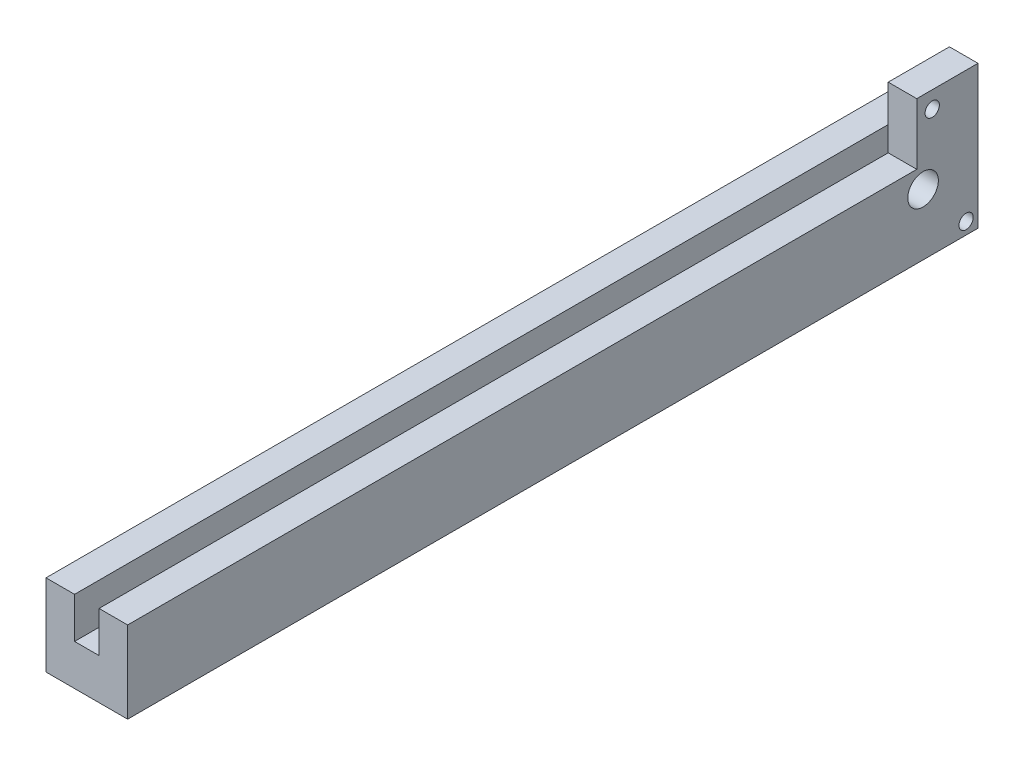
ISO-10303-21;
HEADER;
FILE_DESCRIPTION(('STEP AP214'),'2;1');
FILE_NAME('part.step','',(''),(''),'','','');
FILE_SCHEMA(('AUTOMOTIVE_DESIGN { 1 0 10303 214 1 1 1 1 }'));
ENDSEC;
DATA;
#1=APPLICATION_CONTEXT('core data for automotive mechanical design processes');
#2=APPLICATION_PROTOCOL_DEFINITION('international standard','automotive_design',2000,#1);
#3=PRODUCT_CONTEXT('',#1,'mechanical');
#4=PRODUCT('Part','Part','',(#3));
#5=PRODUCT_RELATED_PRODUCT_CATEGORY('part','',(#4));
#6=PRODUCT_DEFINITION_FORMATION('','',#4);
#7=PRODUCT_DEFINITION_CONTEXT('part definition',#1,'design');
#8=PRODUCT_DEFINITION('design','',#6,#7);
#9=PRODUCT_DEFINITION_SHAPE('','',#8);
#10=(LENGTH_UNIT() NAMED_UNIT(*) SI_UNIT(.MILLI.,.METRE.));
#11=(NAMED_UNIT(*) PLANE_ANGLE_UNIT() SI_UNIT($,.RADIAN.));
#12=(NAMED_UNIT(*) SI_UNIT($,.STERADIAN.) SOLID_ANGLE_UNIT());
#13=UNCERTAINTY_MEASURE_WITH_UNIT(LENGTH_MEASURE(1.E-05),#10,'distance_accuracy_value','');
#14=(GEOMETRIC_REPRESENTATION_CONTEXT(3) GLOBAL_UNCERTAINTY_ASSIGNED_CONTEXT((#13)) GLOBAL_UNIT_ASSIGNED_CONTEXT((#10,
#11,#12)) REPRESENTATION_CONTEXT('',''));
#15=CARTESIAN_POINT('',(0.,0.,0.));
#16=DIRECTION('',(0.,0.,1.));
#17=DIRECTION('',(1.,0.,0.));
#18=AXIS2_PLACEMENT_3D('',#15,#16,#17);
#19=CARTESIAN_POINT('',(-12.,12.,250.));
#20=DIRECTION('',(0.,-1.,0.));
#21=DIRECTION('',(0.,0.,-1.));
#22=AXIS2_PLACEMENT_3D('',#19,#20,#21);
#23=PLANE('',#22);
#24=DIRECTION('',(1.,0.,0.));
#25=VECTOR('',#24,1.);
#26=CARTESIAN_POINT('',(3.6,12.,18.));
#27=LINE('',#26,#25);
#28=CARTESIAN_POINT('',(3.6,12.,18.));
#29=VERTEX_POINT('',#28);
#30=CARTESIAN_POINT('',(12.,12.,18.));
#31=VERTEX_POINT('',#30);
#32=EDGE_CURVE('E52',#29,#31,#27,.T.);
#33=ORIENTED_EDGE('',*,*,#32,.F.);
#34=DIRECTION('',(0.,0.,1.));
#35=VECTOR('',#34,1.);
#36=CARTESIAN_POINT('',(3.6,12.,-12.5283678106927));
#37=LINE('',#36,#35);
#38=CARTESIAN_POINT('',(3.6,12.,250.));
#39=VERTEX_POINT('',#38);
#40=EDGE_CURVE('E138',#29,#39,#37,.T.);
#41=ORIENTED_EDGE('',*,*,#40,.T.);
#42=DIRECTION('',(-1.,0.,0.));
#43=VECTOR('',#42,1.);
#44=CARTESIAN_POINT('',(-12.,12.,250.));
#45=LINE('',#44,#43);
#46=CARTESIAN_POINT('',(12.,12.,250.));
#47=VERTEX_POINT('',#46);
#48=EDGE_CURVE('E172',#47,#39,#45,.T.);
#49=ORIENTED_EDGE('',*,*,#48,.F.);
#50=DIRECTION('',(0.,0.,-1.));
#51=VECTOR('',#50,1.);
#52=CARTESIAN_POINT('',(12.,12.,250.));
#53=LINE('',#52,#51);
#54=EDGE_CURVE('E11',#47,#31,#53,.T.);
#55=ORIENTED_EDGE('',*,*,#54,.T.);
#56=EDGE_LOOP('',(#33,#41,#49,#55));
#57=FACE_BOUND('',#56,.T.);
#58=ADVANCED_FACE('F39',(#57),#23,.F.);
#59=DIRECTION('',(0.,0.,1.));
#60=VECTOR('',#59,1.);
#61=CARTESIAN_POINT('',(-3.6,12.,-12.5283678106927));
#62=LINE('',#61,#60);
#63=CARTESIAN_POINT('',(-3.6,12.,0.));
#64=VERTEX_POINT('',#63);
#65=CARTESIAN_POINT('',(-3.6,12.,250.));
#66=VERTEX_POINT('',#65);
#67=EDGE_CURVE('E141',#64,#66,#62,.T.);
#68=ORIENTED_EDGE('',*,*,#67,.F.);
#69=DIRECTION('',(-1.,0.,0.));
#70=VECTOR('',#69,1.);
#71=CARTESIAN_POINT('',(-12.,12.,0.));
#72=LINE('',#71,#70);
#73=CARTESIAN_POINT('',(-12.,12.,0.));
#74=VERTEX_POINT('',#73);
#75=EDGE_CURVE('E178',#64,#74,#72,.T.);
#76=ORIENTED_EDGE('',*,*,#75,.T.);
#77=DIRECTION('',(0.,0.,-1.));
#78=VECTOR('',#77,1.);
#79=CARTESIAN_POINT('',(-12.,12.,250.));
#80=LINE('',#79,#78);
#81=CARTESIAN_POINT('',(-12.,12.,250.));
#82=VERTEX_POINT('',#81);
#83=EDGE_CURVE('E50',#82,#74,#80,.T.);
#84=ORIENTED_EDGE('',*,*,#83,.F.);
#85=EDGE_CURVE('E166',#66,#82,#45,.T.);
#86=ORIENTED_EDGE('',*,*,#85,.F.);
#87=EDGE_LOOP('',(#68,#76,#84,#86));
#88=FACE_BOUND('',#87,.T.);
#89=ADVANCED_FACE('F215',(#88),#23,.F.);
#90=CARTESIAN_POINT('',(0.,0.,250.));
#91=DIRECTION('',(0.,0.,1.));
#92=DIRECTION('',(1.,0.,0.));
#93=AXIS2_PLACEMENT_3D('',#90,#91,#92);
#94=PLANE('',#93);
#95=DIRECTION('',(1.,0.,0.));
#96=VECTOR('',#95,1.);
#97=CARTESIAN_POINT('',(0.,0.,250.));
#98=LINE('',#97,#96);
#99=CARTESIAN_POINT('',(-3.6,0.,250.));
#100=VERTEX_POINT('',#99);
#101=CARTESIAN_POINT('',(3.6,0.,250.));
#102=VERTEX_POINT('',#101);
#103=EDGE_CURVE('E62',#100,#102,#98,.T.);
#104=ORIENTED_EDGE('',*,*,#103,.F.);
#105=DIRECTION('',(0.,1.,0.));
#106=VECTOR('',#105,1.);
#107=CARTESIAN_POINT('',(-3.6,0.,250.));
#108=LINE('',#107,#106);
#109=EDGE_CURVE('E143',#100,#66,#108,.T.);
#110=ORIENTED_EDGE('',*,*,#109,.T.);
#111=ORIENTED_EDGE('',*,*,#85,.T.);
#112=DIRECTION('',(0.,-1.,0.));
#113=VECTOR('',#112,1.);
#114=CARTESIAN_POINT('',(-12.,12.,250.));
#115=LINE('',#114,#113);
#116=CARTESIAN_POINT('',(-12.,-12.,250.));
#117=VERTEX_POINT('',#116);
#118=EDGE_CURVE('E171',#82,#117,#115,.T.);
#119=ORIENTED_EDGE('',*,*,#118,.T.);
#120=DIRECTION('',(1.,0.,0.));
#121=VECTOR('',#120,1.);
#122=CARTESIAN_POINT('',(-12.,-12.,250.));
#123=LINE('',#122,#121);
#124=CARTESIAN_POINT('',(12.,-12.,250.));
#125=VERTEX_POINT('',#124);
#126=EDGE_CURVE('E177',#117,#125,#123,.T.);
#127=ORIENTED_EDGE('',*,*,#126,.T.);
#128=DIRECTION('',(0.,1.,0.));
#129=VECTOR('',#128,1.);
#130=CARTESIAN_POINT('',(12.,12.,250.));
#131=LINE('',#130,#129);
#132=EDGE_CURVE('E167',#125,#47,#131,.T.);
#133=ORIENTED_EDGE('',*,*,#132,.T.);
#134=ORIENTED_EDGE('',*,*,#48,.T.);
#135=DIRECTION('',(0.,1.,0.));
#136=VECTOR('',#135,1.);
#137=CARTESIAN_POINT('',(3.6,0.,250.));
#138=LINE('',#137,#136);
#139=EDGE_CURVE('E157',#102,#39,#138,.T.);
#140=ORIENTED_EDGE('',*,*,#139,.F.);
#141=EDGE_LOOP('',(#104,#110,#111,#119,#127,#133,#134,#140));
#142=FACE_BOUND('',#141,.T.);
#143=ADVANCED_FACE('F209',(#142),#94,.T.);
#144=CARTESIAN_POINT('',(0.,0.,0.));
#145=DIRECTION('',(0.,0.,1.));
#146=DIRECTION('',(1.,0.,0.));
#147=AXIS2_PLACEMENT_3D('',#144,#145,#146);
#148=PLANE('',#147);
#149=DIRECTION('',(0.,-1.,0.));
#150=VECTOR('',#149,1.);
#151=CARTESIAN_POINT('',(-3.6,0.,0.));
#152=LINE('',#151,#150);
#153=CARTESIAN_POINT('',(-3.6,0.,0.));
#154=VERTEX_POINT('',#153);
#155=EDGE_CURVE('E146',#64,#154,#152,.T.);
#156=ORIENTED_EDGE('',*,*,#155,.T.);
#157=DIRECTION('',(-1.,0.,0.));
#158=VECTOR('',#157,1.);
#159=CARTESIAN_POINT('',(0.,0.,0.));
#160=LINE('',#159,#158);
#161=CARTESIAN_POINT('',(3.6,0.,0.));
#162=VERTEX_POINT('',#161);
#163=EDGE_CURVE('E160',#162,#154,#160,.T.);
#164=ORIENTED_EDGE('',*,*,#163,.F.);
#165=DIRECTION('',(0.,-1.,0.));
#166=VECTOR('',#165,1.);
#167=CARTESIAN_POINT('',(3.6,0.,0.));
#168=LINE('',#167,#166);
#169=CARTESIAN_POINT('',(3.6,30.,0.));
#170=VERTEX_POINT('',#169);
#171=EDGE_CURVE('E154',#170,#162,#168,.T.);
#172=ORIENTED_EDGE('',*,*,#171,.F.);
#173=DIRECTION('',(-1.,0.,0.));
#174=VECTOR('',#173,1.);
#175=CARTESIAN_POINT('',(3.6,30.,0.));
#176=LINE('',#175,#174);
#177=CARTESIAN_POINT('',(12.,30.,0.));
#178=VERTEX_POINT('',#177);
#179=EDGE_CURVE('E131',#178,#170,#176,.T.);
#180=ORIENTED_EDGE('',*,*,#179,.F.);
#181=DIRECTION('',(0.,1.,0.));
#182=VECTOR('',#181,1.);
#183=CARTESIAN_POINT('',(12.,12.,0.));
#184=LINE('',#183,#182);
#185=CARTESIAN_POINT('',(12.,-12.,0.));
#186=VERTEX_POINT('',#185);
#187=EDGE_CURVE('E164',#186,#178,#184,.T.);
#188=ORIENTED_EDGE('',*,*,#187,.F.);
#189=DIRECTION('',(1.,0.,0.));
#190=VECTOR('',#189,1.);
#191=CARTESIAN_POINT('',(-12.,-12.,0.));
#192=LINE('',#191,#190);
#193=CARTESIAN_POINT('',(-12.,-12.,0.));
#194=VERTEX_POINT('',#193);
#195=EDGE_CURVE('E168',#194,#186,#192,.T.);
#196=ORIENTED_EDGE('',*,*,#195,.F.);
#197=DIRECTION('',(0.,-1.,0.));
#198=VECTOR('',#197,1.);
#199=CARTESIAN_POINT('',(-12.,12.,0.));
#200=LINE('',#199,#198);
#201=EDGE_CURVE('E185',#74,#194,#200,.T.);
#202=ORIENTED_EDGE('',*,*,#201,.F.);
#203=ORIENTED_EDGE('',*,*,#75,.F.);
#204=EDGE_LOOP('',(#156,#164,#172,#180,#188,#196,#202,#203));
#205=FACE_BOUND('',#204,.T.);
#206=ADVANCED_FACE('F203',(#205),#148,.F.);
#207=CARTESIAN_POINT('',(12.,12.,250.));
#208=DIRECTION('',(-1.,0.,0.));
#209=DIRECTION('',(0.,-1.,0.));
#210=AXIS2_PLACEMENT_3D('',#207,#208,#209);
#211=PLANE('',#210);
#212=CARTESIAN_POINT('',(12.,-8.5,3.5));
#213=DIRECTION('',(1.,0.,0.));
#214=DIRECTION('',(0.,1.,0.));
#215=AXIS2_PLACEMENT_3D('',#212,#213,#214);
#216=CIRCLE('',#215,2.09999999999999);
#217=CARTESIAN_POINT('',(12.,-6.40000000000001,3.5));
#218=VERTEX_POINT('',#217);
#219=EDGE_CURVE('E347',#218,#218,#216,.T.);
#220=ORIENTED_EDGE('',*,*,#219,.F.);
#221=EDGE_LOOP('',(#220));
#222=FACE_BOUND('',#221,.T.);
#223=CARTESIAN_POINT('',(12.,6.,16.1491106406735));
#224=DIRECTION('',(1.,0.,0.));
#225=DIRECTION('',(0.,1.,0.));
#226=AXIS2_PLACEMENT_3D('',#223,#224,#225);
#227=CIRCLE('',#226,4.50000000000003);
#228=CARTESIAN_POINT('',(12.,10.5,16.1491106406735));
#229=VERTEX_POINT('',#228);
#230=EDGE_CURVE('E349',#229,#229,#227,.T.);
#231=ORIENTED_EDGE('',*,*,#230,.F.);
#232=EDGE_LOOP('',(#231));
#233=FACE_BOUND('',#232,.T.);
#234=CARTESIAN_POINT('',(12.,25.053007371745,13.4597036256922));
#235=DIRECTION('',(1.,0.,0.));
#236=DIRECTION('',(0.,1.,0.));
#237=AXIS2_PLACEMENT_3D('',#234,#235,#236);
#238=CIRCLE('',#237,2.09999999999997);
#239=CARTESIAN_POINT('',(12.,27.153007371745,13.4597036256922));
#240=VERTEX_POINT('',#239);
#241=EDGE_CURVE('E353',#240,#240,#238,.T.);
#242=ORIENTED_EDGE('',*,*,#241,.F.);
#243=EDGE_LOOP('',(#242));
#244=FACE_BOUND('',#243,.T.);
#245=ORIENTED_EDGE('',*,*,#187,.T.);
#246=DIRECTION('',(0.,0.,-1.));
#247=VECTOR('',#246,1.);
#248=CARTESIAN_POINT('',(12.,30.,0.));
#249=LINE('',#248,#247);
#250=CARTESIAN_POINT('',(12.,30.,18.));
#251=VERTEX_POINT('',#250);
#252=EDGE_CURVE('E130',#251,#178,#249,.T.);
#253=ORIENTED_EDGE('',*,*,#252,.F.);
#254=DIRECTION('',(0.,-1.,0.));
#255=VECTOR('',#254,1.);
#256=CARTESIAN_POINT('',(12.,30.,18.));
#257=LINE('',#256,#255);
#258=EDGE_CURVE('E125',#251,#31,#257,.T.);
#259=ORIENTED_EDGE('',*,*,#258,.T.);
#260=ORIENTED_EDGE('',*,*,#54,.F.);
#261=ORIENTED_EDGE('',*,*,#132,.F.);
#262=DIRECTION('',(0.,0.,-1.));
#263=VECTOR('',#262,1.);
#264=CARTESIAN_POINT('',(12.,-12.,250.));
#265=LINE('',#264,#263);
#266=EDGE_CURVE('E180',#125,#186,#265,.T.);
#267=ORIENTED_EDGE('',*,*,#266,.T.);
#268=EDGE_LOOP('',(#245,#253,#259,#260,#261,#267));
#269=FACE_BOUND('',#268,.T.);
#270=ADVANCED_FACE('F41',(#222,#233,#244,#269),#211,.F.);
#271=CARTESIAN_POINT('',(-12.,12.,250.));
#272=DIRECTION('',(1.,0.,0.));
#273=DIRECTION('',(0.,1.,0.));
#274=AXIS2_PLACEMENT_3D('',#271,#272,#273);
#275=PLANE('',#274);
#276=ORIENTED_EDGE('',*,*,#201,.T.);
#277=DIRECTION('',(0.,0.,-1.));
#278=VECTOR('',#277,1.);
#279=CARTESIAN_POINT('',(-12.,-12.,250.));
#280=LINE('',#279,#278);
#281=EDGE_CURVE('E189',#117,#194,#280,.T.);
#282=ORIENTED_EDGE('',*,*,#281,.F.);
#283=ORIENTED_EDGE('',*,*,#118,.F.);
#284=ORIENTED_EDGE('',*,*,#83,.T.);
#285=EDGE_LOOP('',(#276,#282,#283,#284));
#286=FACE_BOUND('',#285,.T.);
#287=ADVANCED_FACE('F191',(#286),#275,.F.);
#288=CARTESIAN_POINT('',(-12.,-12.,250.));
#289=DIRECTION('',(0.,1.,0.));
#290=DIRECTION('',(0.,0.,1.));
#291=AXIS2_PLACEMENT_3D('',#288,#289,#290);
#292=PLANE('',#291);
#293=ORIENTED_EDGE('',*,*,#195,.T.);
#294=ORIENTED_EDGE('',*,*,#266,.F.);
#295=ORIENTED_EDGE('',*,*,#126,.F.);
#296=ORIENTED_EDGE('',*,*,#281,.T.);
#297=EDGE_LOOP('',(#293,#294,#295,#296));
#298=FACE_BOUND('',#297,.T.);
#299=ADVANCED_FACE('F202',(#298),#292,.F.);
#300=CARTESIAN_POINT('',(3.6,0.,-12.5283678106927));
#301=DIRECTION('',(1.,0.,0.));
#302=DIRECTION('',(0.,1.,0.));
#303=AXIS2_PLACEMENT_3D('',#300,#301,#302);
#304=PLANE('',#303);
#305=CARTESIAN_POINT('',(3.6,6.,16.1491106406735));
#306=DIRECTION('',(1.,0.,0.));
#307=DIRECTION('',(0.,1.,0.));
#308=AXIS2_PLACEMENT_3D('',#305,#306,#307);
#309=CIRCLE('',#308,4.50000000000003);
#310=CARTESIAN_POINT('',(3.6,10.5,16.1491106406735));
#311=VERTEX_POINT('',#310);
#312=EDGE_CURVE('E354',#311,#311,#309,.F.);
#313=ORIENTED_EDGE('',*,*,#312,.F.);
#314=EDGE_LOOP('',(#313));
#315=FACE_BOUND('',#314,.T.);
#316=CARTESIAN_POINT('',(3.6,25.053007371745,13.4597036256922));
#317=DIRECTION('',(1.,0.,0.));
#318=DIRECTION('',(0.,1.,0.));
#319=AXIS2_PLACEMENT_3D('',#316,#317,#318);
#320=CIRCLE('',#319,2.09999999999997);
#321=CARTESIAN_POINT('',(3.6,27.153007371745,13.4597036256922));
#322=VERTEX_POINT('',#321);
#323=EDGE_CURVE('E360',#322,#322,#320,.F.);
#324=ORIENTED_EDGE('',*,*,#323,.F.);
#325=EDGE_LOOP('',(#324));
#326=FACE_BOUND('',#325,.T.);
#327=ORIENTED_EDGE('',*,*,#171,.T.);
#328=DIRECTION('',(0.,0.,1.));
#329=VECTOR('',#328,1.);
#330=CARTESIAN_POINT('',(3.6,0.,-12.5283678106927));
#331=LINE('',#330,#329);
#332=EDGE_CURVE('E161',#162,#102,#331,.T.);
#333=ORIENTED_EDGE('',*,*,#332,.T.);
#334=ORIENTED_EDGE('',*,*,#139,.T.);
#335=ORIENTED_EDGE('',*,*,#40,.F.);
#336=DIRECTION('',(0.,-1.,0.));
#337=VECTOR('',#336,1.);
#338=CARTESIAN_POINT('',(3.6,30.,18.));
#339=LINE('',#338,#337);
#340=CARTESIAN_POINT('',(3.6,30.,18.));
#341=VERTEX_POINT('',#340);
#342=EDGE_CURVE('E122',#341,#29,#339,.T.);
#343=ORIENTED_EDGE('',*,*,#342,.F.);
#344=DIRECTION('',(0.,0.,1.));
#345=VECTOR('',#344,1.);
#346=CARTESIAN_POINT('',(3.6,30.,0.));
#347=LINE('',#346,#345);
#348=EDGE_CURVE('E126',#170,#341,#347,.T.);
#349=ORIENTED_EDGE('',*,*,#348,.F.);
#350=EDGE_LOOP('',(#327,#333,#334,#335,#343,#349));
#351=FACE_BOUND('',#350,.T.);
#352=ADVANCED_FACE('F140',(#315,#326,#351),#304,.F.);
#353=CARTESIAN_POINT('',(0.,0.,-12.5283678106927));
#354=DIRECTION('',(0.,-1.,0.));
#355=DIRECTION('',(0.,0.,-1.));
#356=AXIS2_PLACEMENT_3D('',#353,#354,#355);
#357=PLANE('',#356);
#358=ORIENTED_EDGE('',*,*,#163,.T.);
#359=DIRECTION('',(0.,0.,1.));
#360=VECTOR('',#359,1.);
#361=CARTESIAN_POINT('',(-3.6,0.,-12.5283678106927));
#362=LINE('',#361,#360);
#363=EDGE_CURVE('E147',#154,#100,#362,.T.);
#364=ORIENTED_EDGE('',*,*,#363,.T.);
#365=ORIENTED_EDGE('',*,*,#103,.T.);
#366=ORIENTED_EDGE('',*,*,#332,.F.);
#367=EDGE_LOOP('',(#358,#364,#365,#366));
#368=FACE_BOUND('',#367,.T.);
#369=ADVANCED_FACE('F217',(#368),#357,.F.);
#370=CARTESIAN_POINT('',(-3.6,0.,-12.5283678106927));
#371=DIRECTION('',(1.,0.,0.));
#372=DIRECTION('',(0.,1.,0.));
#373=AXIS2_PLACEMENT_3D('',#370,#371,#372);
#374=PLANE('',#373);
#375=ORIENTED_EDGE('',*,*,#67,.T.);
#376=ORIENTED_EDGE('',*,*,#109,.F.);
#377=ORIENTED_EDGE('',*,*,#363,.F.);
#378=ORIENTED_EDGE('',*,*,#155,.F.);
#379=EDGE_LOOP('',(#375,#376,#377,#378));
#380=FACE_BOUND('',#379,.T.);
#381=ADVANCED_FACE('F212',(#380),#374,.T.);
#382=CARTESIAN_POINT('',(3.6,30.,18.));
#383=DIRECTION('',(0.,0.,-1.));
#384=DIRECTION('',(-1.,0.,0.));
#385=AXIS2_PLACEMENT_3D('',#382,#383,#384);
#386=PLANE('',#385);
#387=ORIENTED_EDGE('',*,*,#32,.T.);
#388=ORIENTED_EDGE('',*,*,#258,.F.);
#389=DIRECTION('',(1.,0.,0.));
#390=VECTOR('',#389,1.);
#391=CARTESIAN_POINT('',(3.6,30.,18.));
#392=LINE('',#391,#390);
#393=EDGE_CURVE('E119',#341,#251,#392,.T.);
#394=ORIENTED_EDGE('',*,*,#393,.F.);
#395=ORIENTED_EDGE('',*,*,#342,.T.);
#396=EDGE_LOOP('',(#387,#388,#394,#395));
#397=FACE_BOUND('',#396,.T.);
#398=ADVANCED_FACE('F116',(#397),#386,.F.);
#399=CARTESIAN_POINT('',(0.,30.,0.));
#400=DIRECTION('',(0.,1.,0.));
#401=DIRECTION('',(0.,0.,1.));
#402=AXIS2_PLACEMENT_3D('',#399,#400,#401);
#403=PLANE('',#402);
#404=ORIENTED_EDGE('',*,*,#348,.T.);
#405=ORIENTED_EDGE('',*,*,#393,.T.);
#406=ORIENTED_EDGE('',*,*,#252,.T.);
#407=ORIENTED_EDGE('',*,*,#179,.T.);
#408=EDGE_LOOP('',(#404,#405,#406,#407));
#409=FACE_BOUND('',#408,.T.);
#410=ADVANCED_FACE('F134',(#409),#403,.T.);
#411=CARTESIAN_POINT('',(-9.12792206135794,25.053007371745,13.4597036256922));
#412=DIRECTION('',(1.,0.,0.));
#413=DIRECTION('',(0.,1.,0.));
#414=AXIS2_PLACEMENT_3D('',#411,#412,#413);
#415=CYLINDRICAL_SURFACE('',#414,2.09999999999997);
#416=ORIENTED_EDGE('',*,*,#323,.T.);
#417=EDGE_LOOP('',(#416));
#418=FACE_BOUND('',#417,.T.);
#419=ORIENTED_EDGE('',*,*,#241,.T.);
#420=EDGE_LOOP('',(#419));
#421=FACE_BOUND('',#420,.T.);
#422=ADVANCED_FACE('F304',(#418,#421),#415,.F.);
#423=CARTESIAN_POINT('',(-9.12792206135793,6.,16.1491106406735));
#424=DIRECTION('',(1.,0.,0.));
#425=DIRECTION('',(0.,1.,0.));
#426=AXIS2_PLACEMENT_3D('',#423,#424,#425);
#427=CYLINDRICAL_SURFACE('',#426,4.50000000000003);
#428=ORIENTED_EDGE('',*,*,#312,.T.);
#429=EDGE_LOOP('',(#428));
#430=FACE_BOUND('',#429,.T.);
#431=ORIENTED_EDGE('',*,*,#230,.T.);
#432=EDGE_LOOP('',(#431));
#433=FACE_BOUND('',#432,.T.);
#434=ADVANCED_FACE('F309',(#430,#433),#427,.F.);
#435=CARTESIAN_POINT('',(-9.12792206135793,-8.5,3.5));
#436=DIRECTION('',(1.,0.,0.));
#437=DIRECTION('',(0.,1.,0.));
#438=AXIS2_PLACEMENT_3D('',#435,#436,#437);
#439=CYLINDRICAL_SURFACE('',#438,2.09999999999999);
#440=CARTESIAN_POINT('',(3.6,-8.5,3.5));
#441=DIRECTION('',(1.,0.,0.));
#442=DIRECTION('',(0.,1.,0.));
#443=AXIS2_PLACEMENT_3D('',#440,#441,#442);
#444=CIRCLE('',#443,2.09999999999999);
#445=CARTESIAN_POINT('',(3.6,-6.40000000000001,3.5));
#446=VERTEX_POINT('',#445);
#447=EDGE_CURVE('E343',#446,#446,#444,.F.);
#448=ORIENTED_EDGE('',*,*,#447,.T.);
#449=EDGE_LOOP('',(#448));
#450=FACE_BOUND('',#449,.T.);
#451=ORIENTED_EDGE('',*,*,#219,.T.);
#452=EDGE_LOOP('',(#451));
#453=FACE_BOUND('',#452,.T.);
#454=ADVANCED_FACE('F319',(#450,#453),#439,.F.);
#455=CARTESIAN_POINT('',(3.6,0.,-12.5283678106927));
#456=DIRECTION('',(1.,0.,0.));
#457=DIRECTION('',(0.,1.,0.));
#458=AXIS2_PLACEMENT_3D('',#455,#456,#457);
#459=PLANE('',#458);
#460=ORIENTED_EDGE('',*,*,#447,.F.);
#461=EDGE_LOOP('',(#460));
#462=FACE_BOUND('',#461,.T.);
#463=ADVANCED_FACE('F329',(#462),#459,.T.);
#464=CLOSED_SHELL('',(#58,#89,#143,#206,#270,#287,#299,#352,#369,#381,#398,#410,#422,#434,#454,#463));
#465=MANIFOLD_SOLID_BREP('B2',#464);
#466=ADVANCED_BREP_SHAPE_REPRESENTATION('',(#18,#465),#14);
#467=SHAPE_DEFINITION_REPRESENTATION(#9,#466);
ENDSEC;
END-ISO-10303-21;
